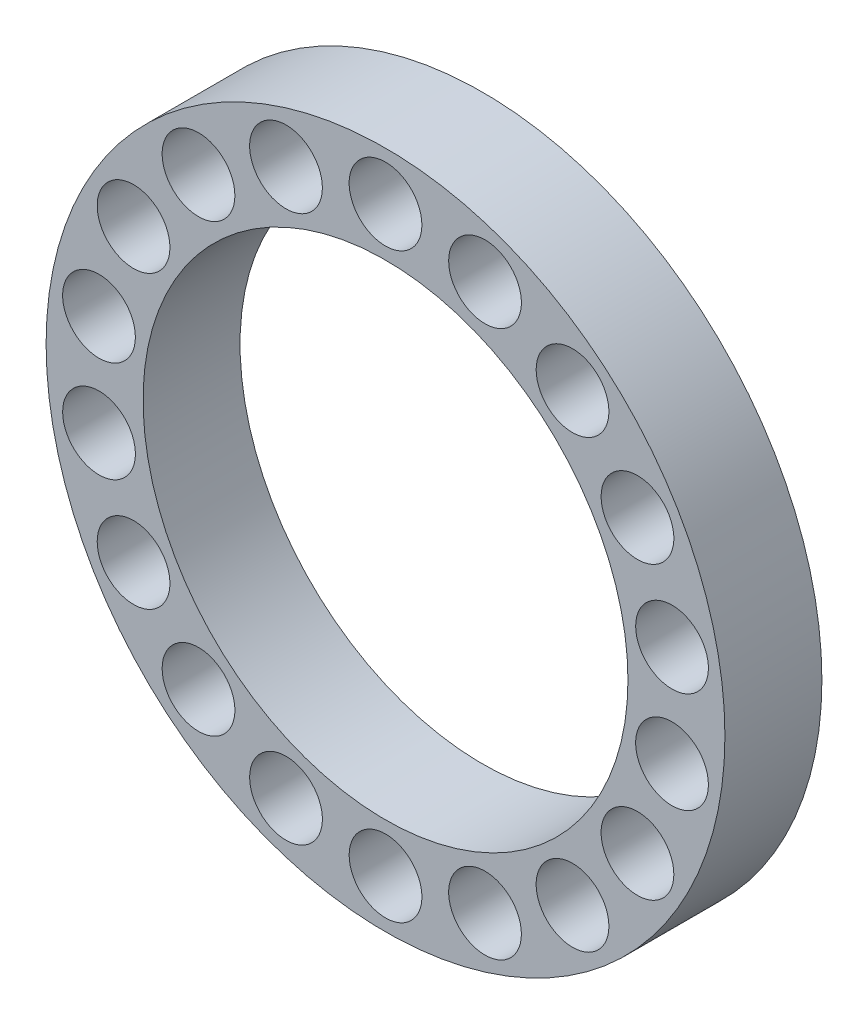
from build123d import *

# Parameters (mm, degrees)
SKETCH1_R           = 8.89
SKETCH1_R_2         = 6.35
BOSS_EXTRUDE1_DEPTH = 2.54
SKETCH2_R           = 0.9525
CUT_EXTRUDE2_DEPTH  = 2.54


with BuildPart() as part:
    # Sketch1 → Boss-Extrude1 (new body)
    with BuildSketch(Plane.XY):
        Circle(SKETCH1_R)
        Circle(SKETCH1_R_2, mode=Mode.SUBTRACT)
    extrude(amount=BOSS_EXTRUDE1_DEPTH)

    # Sketch2 → Cut-Extrude2 (cut)
    with BuildSketch(Plane.XY):
        with Locations((-4.898041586, 5.837258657)):
            Circle(SKETCH2_R)
        with Locations((-6.599113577, 3.81)):
            Circle(SKETCH2_R)
        with Locations((-7.504235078, 1.323199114)):
            Circle(SKETCH2_R)
        with Locations((0, 7.62)):
            Circle(SKETCH2_R)
        with Locations((-2.606193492, 7.16045777)):
            Circle(SKETCH2_R)
        with Locations(Location((-2.606193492, -7.16045777, 0), (0, 0, 180))):
            Circle(SKETCH2_R)
        with Locations(Location((0, -7.62, 0), (0, 0, 180))):
            Circle(SKETCH2_R)
        with Locations(Location((-7.504235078, -1.323199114, 0), (0, 0, 180))):
            Circle(SKETCH2_R)
        with Locations(Location((-6.599113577, -3.81, 0), (0, 0, 180))):
            Circle(SKETCH2_R)
        with Locations(Location((-4.898041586, -5.837258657, 0), (0, 0, 180))):
            Circle(SKETCH2_R)
        with Locations((4.898041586, -5.837258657)):
            Circle(SKETCH2_R)
        with Locations((6.599113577, -3.81)):
            Circle(SKETCH2_R)
        with Locations((7.504235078, -1.323199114)):
            Circle(SKETCH2_R)
        with Locations((2.606193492, -7.16045777)):
            Circle(SKETCH2_R)
        with Locations(Location((2.606193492, 7.16045777, 0), (0, 0, 180))):
            Circle(SKETCH2_R)
        with Locations(Location((7.504235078, 1.323199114, 0), (0, 0, 180))):
            Circle(SKETCH2_R)
        with Locations(Location((6.599113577, 3.81, 0), (0, 0, 180))):
            Circle(SKETCH2_R)
        with Locations(Location((4.898041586, 5.837258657, 0), (0, 0, 180))):
            Circle(SKETCH2_R)
    extrude(amount=CUT_EXTRUDE2_DEPTH, mode=Mode.SUBTRACT)


solid = part.part
